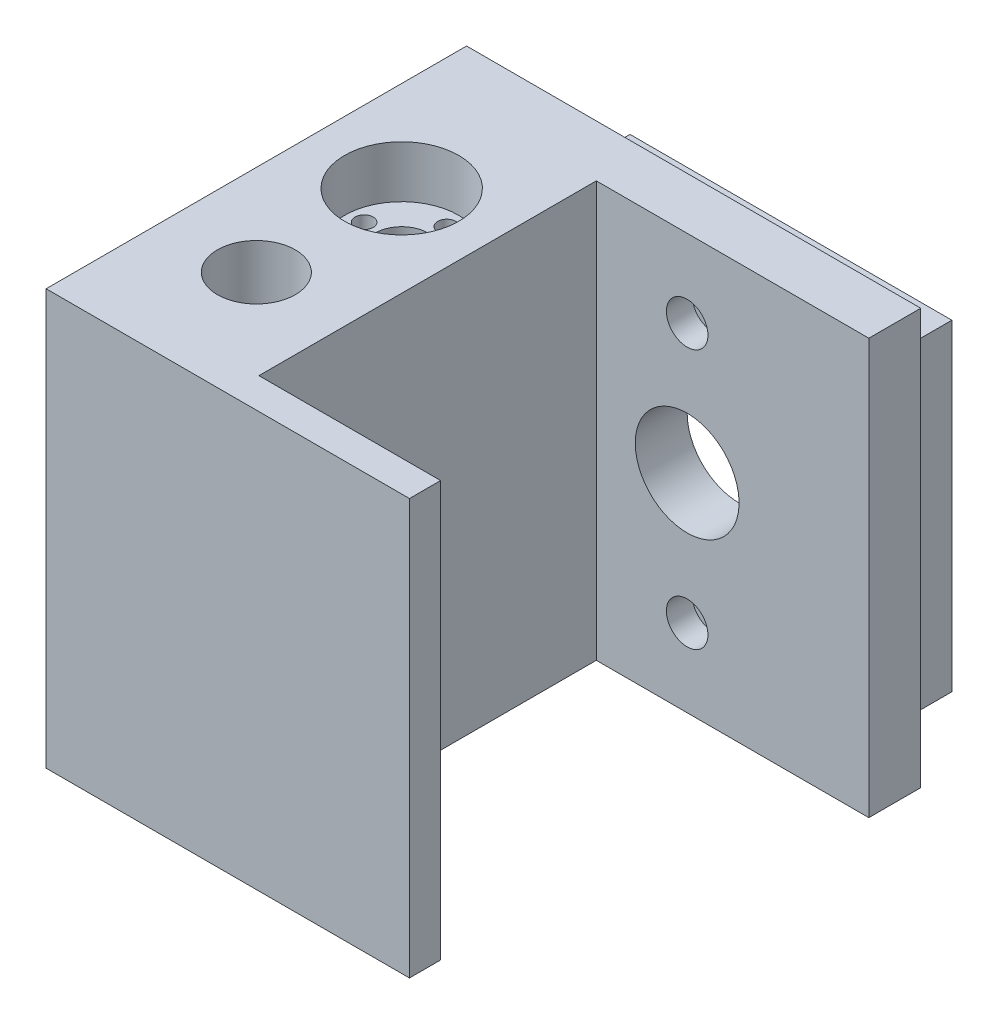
from build123d import *

# Parameters (mm, degrees)
SKETCH1_W           = 65
SKETCH1_H           = 80
BOSS_EXTRUDE1_DEPTH = 35
SKETCH2_R           = 7.5
CUT_EXTRUDE1_DEPTH  = 75
SKETCH2_3_R         = 11
SKETCH2_3_R_2       = 5.1
CUT_EXTRUDE2_DEPTH  = 10
SKETCH2_4_R         = 5.1
CUT_EXTRUDE3_DEPTH  = 109.857705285
SKETCH9_W           = 70
SKETCH9_H           = 6
SKETCH9_W_2         = 87.5
SKETCH9_H_2         = 10
BOSS_EXTRUDE2_DEPTH = 80
CUT_EXTRUDE5_START  = -5
SKETCH10_R          = 4
SKETCH10_R_2        = 5.1
CUT_EXTRUDE5_DEPTH  = 71
SKETCH6_R           = 1.75
CUT_EXTRUDE6_DEPTH  = 10
SKETCH11_R          = 10
CUT_EXTRUDE8_DEPTH  = 10
SKETCH5_R           = 4
CUT_EXTRUDE9_DEPTH  = 139.192800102
SKETCH13_W          = 62
SKETCH13_H          = 62
SKETCH13_W_2        = 56
SKETCH13_H_2        = 56
BOSS_EXTRUDE3_DEPTH = 10


with BuildPart() as part:
    # Sketch1 → Boss-Extrude1 (new body)
    with BuildSketch(Plane(origin=(0, 0, 0), x_dir=(0, 0, -1), z_dir=(1, 0, 0))):
        with Locations((-32.5, 40)):
            Rectangle(SKETCH1_W, SKETCH1_H)
    extrude(amount=BOSS_EXTRUDE1_DEPTH)

    # Sketch2 → Cut-Extrude1 (cut)
    with BuildSketch(Plane(origin=(0, 80, 0), x_dir=(1, 0, 0), z_dir=(0, 1, 0))):
        with Locations(Location((17.5, -48, 0), (0, 0, 270))):
            Circle(SKETCH2_R)
    extrude(amount=-CUT_EXTRUDE1_DEPTH, mode=Mode.SUBTRACT)

    # Sketch2_3 → Cut-Extrude2 (cut)
    with BuildSketch(Plane(origin=(0, 80, 0), x_dir=(1, 0, 0), z_dir=(0, 1, 0))):
        with Locations(Location((17.5, -20, 0), (0, 0, 90))):
            Circle(SKETCH2_3_R)
        with Locations(Location((17.5, -20, 0), (0, 0, 90))):
            Circle(SKETCH2_3_R_2, mode=Mode.SUBTRACT)
    extrude(amount=-CUT_EXTRUDE2_DEPTH, mode=Mode.SUBTRACT)

    # Sketch2_4 → Cut-Extrude3 (cut, through all)
    with BuildSketch(Plane(origin=(0, 80, 0), x_dir=(1, 0, 0), z_dir=(0, 1, 0))):
        with Locations(Location((17.5, -20, 0), (0, 0, 270))):
            Circle(SKETCH2_4_R)
    extrude(amount=-CUT_EXTRUDE3_DEPTH, mode=Mode.SUBTRACT)

    # Sketch9 → Boss-Extrude2 (add)
    with BuildSketch(Plane(origin=(0, 0, 0), x_dir=(1, 0, 0), z_dir=(0, 1, 0))):
        with Locations((35, -68)):
            Rectangle(SKETCH9_W, SKETCH9_H)
        with Locations((43.75, 5)):
            Rectangle(SKETCH9_W_2, SKETCH9_H_2)
    extrude(amount=BOSS_EXTRUDE2_DEPTH)

    # Sketch10 → Cut-Extrude5 (cut)
    with BuildSketch(Plane.XY.offset(71).offset(CUT_EXTRUDE5_START)):
        with Locations((52.5, 65)):
            Circle(SKETCH10_R)
        with Locations((52.5, 15)):
            Circle(SKETCH10_R)
        with Locations((52.5, 40)):
            Circle(SKETCH10_R_2)
    extrude(amount=-CUT_EXTRUDE5_DEPTH, mode=Mode.SUBTRACT)

    # Sketch6 → Cut-Extrude6 (cut)
    with BuildSketch(Plane(origin=(0, 70, 0), x_dir=(1, 0, 0), z_dir=(0, 1, 0))):
        with Locations(Location((16.773942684, -27.966984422, 0), (0, 0, 270))):
            Circle(SKETCH6_R)
        with Locations(Location((9.533015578, -19.273942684, 0), (0, 0, 270))):
            Circle(SKETCH6_R)
        with Locations(Location((18.226057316, -12.033015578, 0), (0, 0, 270))):
            Circle(SKETCH6_R)
        with Locations(Location((25.466984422, -20.726057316, 0), (0, 0, 270))):
            Circle(SKETCH6_R)
    extrude(amount=-CUT_EXTRUDE6_DEPTH, mode=Mode.SUBTRACT)

    # Sketch11 → Cut-Extrude8 (cut)
    with BuildSketch(Plane(origin=(0, 0, -10), x_dir=(-1, 0, 0), z_dir=(0, 0, -1))):
        with Locations((-52.5, 40)):
            Circle(SKETCH11_R)
    extrude(amount=-CUT_EXTRUDE8_DEPTH, mode=Mode.SUBTRACT)

    # Sketch5 → Cut-Extrude9 (cut, through all)
    with BuildSketch(Plane(origin=(0, 80, 0), x_dir=(1, 0, 0), z_dir=(0, 1, 0))):
        with Locations(Location((17.5, -48, 0), (0, 0, 270))):
            Circle(SKETCH5_R)
    extrude(amount=-CUT_EXTRUDE9_DEPTH, mode=Mode.SUBTRACT)

    # Sketch13 → Boss-Extrude3 (add)
    with BuildSketch(Plane(origin=(0, 0, -10), x_dir=(-1, 0, 0), z_dir=(0, 0, -1))):
        with Locations((-52.5, 40)):
            Rectangle(SKETCH13_W, SKETCH13_H)
        with Locations((-52.5, 40)):
            Rectangle(SKETCH13_W_2, SKETCH13_H_2, mode=Mode.SUBTRACT)
    extrude(amount=BOSS_EXTRUDE3_DEPTH)


solid = part.part
